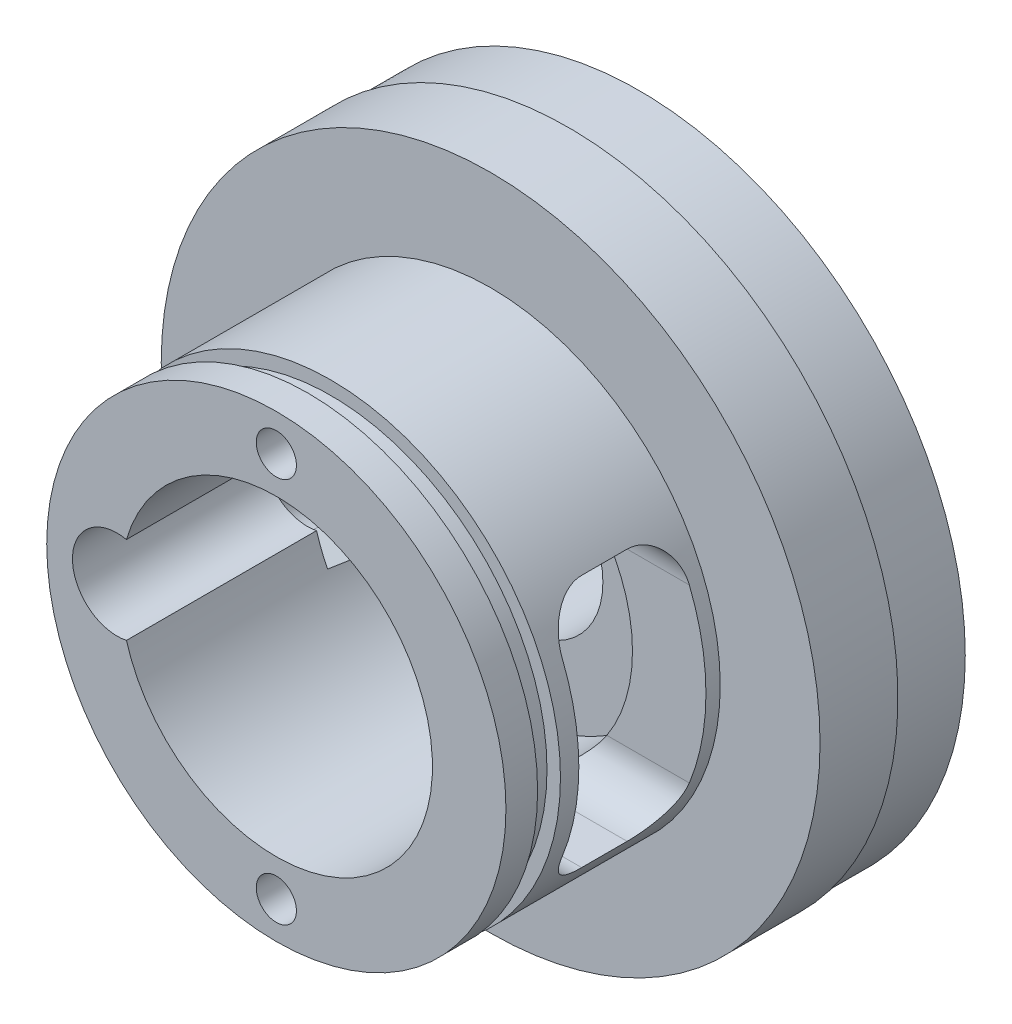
from build123d import *

# Parameters (mm, degrees)
SKETCH1_R                 = 20.4978
EXTRUDE1_DEPTH            = 28.59532
SKETCH12_OUTSIDE_W        = 55.924
SKETCH12_OUTSIDE_H        = 55.924
SKETCH12_OUTSIDE_R        = 14.2875
CUT_EXTRUDE6_DEPTH        = 13.335
SKETCH13_W                = 0.8382
SKETCH13_H                = 1.4224
SKETCH15_R                = 9.7155
CUT_EXTRUDE8_DEPTH        = 15.24
SKETCH16_R                = 5.08
CUT_EXTRUDE9_DEPTH        = 41.718692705
SKETCH9_R                 = 2.77876
CUT_EXTRUDE5_DEPTH        = 41.718692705
CUT_EXTRUDE11_DEPTH       = 7.874
CUT_EXTRUDE11_DEPTH_BACK  = 7.874
SKETCH20_W                = 8.89
SKETCH20_H                = 7.90956
SKETCH21_OUTSIDE_W        = 55.924
SKETCH21_OUTSIDE_H        = 55.924
SKETCH21_OUTSIDE_R        = 20.2946
CUT_EXTRUDE12_DEPTH       = 10.414
FILLET2_R                 = 2.54
CHAMFER1_SIZE             = 0.254
M3X0_5_TAPPED_HOLE1_D     = 2.5
M3X0_5_TAPPED_HOLE1_DEPTH = 10.389997
SKETCH24_W                = 12.7
SKETCH24_H                = 45.72
CUT_EXTRUDE13_DEPTH       = 20.32
WIRING_POCKET_DEPTH       = 10.7442
WIRING_POCKET_DRAFT       = 6


with BuildPart() as part:
    # Sketch1 → Extrude1 (new body)
    with BuildSketch(Plane.XY):
        Circle(SKETCH1_R)
    extrude(amount=EXTRUDE1_DEPTH)

    # Sketch12 outside → Cut-Extrude6 (cut)
    with BuildSketch(Plane.XY.offset(28.59532)):
        Rectangle(SKETCH12_OUTSIDE_W, SKETCH12_OUTSIDE_H)
        Circle(SKETCH12_OUTSIDE_R, mode=Mode.SUBTRACT)
    extrude(amount=-CUT_EXTRUDE6_DEPTH, mode=Mode.SUBTRACT)

    # Sketch13 → Cut-Revolve1 (revolve, cut)
    with BuildSketch(Plane(origin=(0, 0, 0), x_dir=(1, 0, 0), z_dir=(0, 1, 0))):
        with Locations((13.8684, -25.91308)):
            Rectangle(SKETCH13_W, SKETCH13_H)
    revolve(axis=Axis((0, 0, 0), (0, 0, 1)), mode=Mode.SUBTRACT)

    # Sketch15 → Cut-Extrude8 (cut)
    with BuildSketch(Plane.XY.offset(28.59532)):
        Circle(SKETCH15_R)
    extrude(amount=-CUT_EXTRUDE8_DEPTH, mode=Mode.SUBTRACT)

    # Sketch16 → Cut-Extrude9 (cut, through all)
    with BuildSketch(Plane(origin=(0, 0, 0), x_dir=(-1, 0, 0), z_dir=(0, 0, -1))):
        Circle(SKETCH16_R)
    extrude(amount=-CUT_EXTRUDE9_DEPTH, mode=Mode.SUBTRACT)

    # Sketch9 → Cut-Extrude5 (cut, through all)
    with BuildSketch(Plane.XY.offset(28.59532)):
        with Locations((-9.906, 0)):
            Circle(SKETCH9_R)
    extrude(amount=-CUT_EXTRUDE5_DEPTH, mode=Mode.SUBTRACT)

    # Sketch20 → Cut-Extrude11 (cut, two sides: drawn at the far end of the back side and taken through both)
    with BuildSketch(Plane(origin=(0, 0, 0), x_dir=(1, 0, 0), z_dir=(0, 1, 0)).offset(-CUT_EXTRUDE11_DEPTH_BACK)):
        with Locations((9.8425, -20.1041)):
            Rectangle(SKETCH20_W, SKETCH20_H)
    extrude(amount=CUT_EXTRUDE11_DEPTH + CUT_EXTRUDE11_DEPTH_BACK, mode=Mode.SUBTRACT)

    # Sketch21 outside → Cut-Extrude12 (cut)
    with BuildSketch(Plane(origin=(0, 0, 0), x_dir=(-1, 0, 0), z_dir=(0, 0, -1))):
        Rectangle(SKETCH21_OUTSIDE_W, SKETCH21_OUTSIDE_H)
        Circle(SKETCH21_OUTSIDE_R, mode=Mode.SUBTRACT)
    extrude(amount=-CUT_EXTRUDE12_DEPTH, mode=Mode.SUBTRACT)

    # Fillet2
    fillet2_edges = [part.edges().sort_by_distance(p)[0] for p in [
        (8.806630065, -7.874, 16.14932),
        (8.806630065, -7.874, 24.05888),
        (8.806630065, 7.874, 16.14932),
        (8.806630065, 7.874, 24.05888),
    ]]
    fillet(fillet2_edges, radius=FILLET2_R)

    # Chamfer1
    chamfer1_edges = [part.edges().sort_by_distance(p)[0] for p in [
        (20.2946, 0, 0),
    ]]
    chamfer(chamfer1_edges, length=CHAMFER1_SIZE)

    # M3x0.5 Tapped Hole1
    with Locations(Plane.XY.offset(28.59532)):
        with Locations((0, 12.0015), (0, -12.0015)):
            Hole(M3X0_5_TAPPED_HOLE1_D / 2, depth=M3X0_5_TAPPED_HOLE1_DEPTH)

    # Sketch24 → Cut-Extrude13 (cut, symmetric)
    with BuildSketch(Plane(origin=(0, 0, 0), x_dir=(0, 0, -1), z_dir=(1, 0, 0))):
        with Locations((0.3302, 0)):
            Rectangle(SKETCH24_W, SKETCH24_H)
    extrude(amount=CUT_EXTRUDE13_DEPTH, both=True, mode=Mode.SUBTRACT)


with BuildPart() as wiring_pocket_tool:
    # Sketch26 → Wiring Pocket (with draft: the straight prism first)
    with BuildSketch(Plane.XY.offset(16.764)):
        with BuildLine():
            Line((-8.39724, 4.445), (-11.41476, 4.445))
            ThreePointArc((-11.41476, 4.445), (-12.312785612, 4.073025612), (-12.68476, 3.175))
            Line((-12.68476, 3.175), (-12.68476, -3.175))
            ThreePointArc((-12.68476, -3.175), (-12.312785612, -4.073025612), (-11.41476, -4.445))
            Line((-11.41476, -4.445), (-8.39724, -4.445))
            ThreePointArc((-8.39724, -4.445), (-7.499214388, -4.073025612), (-7.12724, -3.175))
            Line((-7.12724, -3.175), (-7.12724, 3.175))
            ThreePointArc((-7.12724, 3.175), (-7.499214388, 4.073025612), (-8.39724, 4.445))
        make_face()
    extrude(amount=-WIRING_POCKET_DEPTH)
    # Wiring Pocket: the draft: its side faces are tilted about the plane it starts from
    wiring_pocket_sides = [wiring_pocket_tool.faces().sort_by_distance(p)[0] for p in [
        (-7.12724, 0, 11.3919),
        (-7.499214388, 4.073025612, 11.3919),
        (-9.906, 4.445, 11.3919),
        (-12.312785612, 4.073025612, 11.3919),
        (-12.68476, 0, 11.3919),
        (-12.312785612, -4.073025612, 11.3919),
        (-9.906, -4.445, 11.3919),
        (-7.499214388, -4.073025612, 11.3919),
    ]]
    draft(wiring_pocket_sides, Plane.XY.offset(16.764), WIRING_POCKET_DRAFT)


with BuildPart() as part_1:
    add(part.part)

    # Wiring Pocket: cut by wiring_pocket_tool
    add(wiring_pocket_tool.part, mode=Mode.SUBTRACT)


solid = part_1.part
